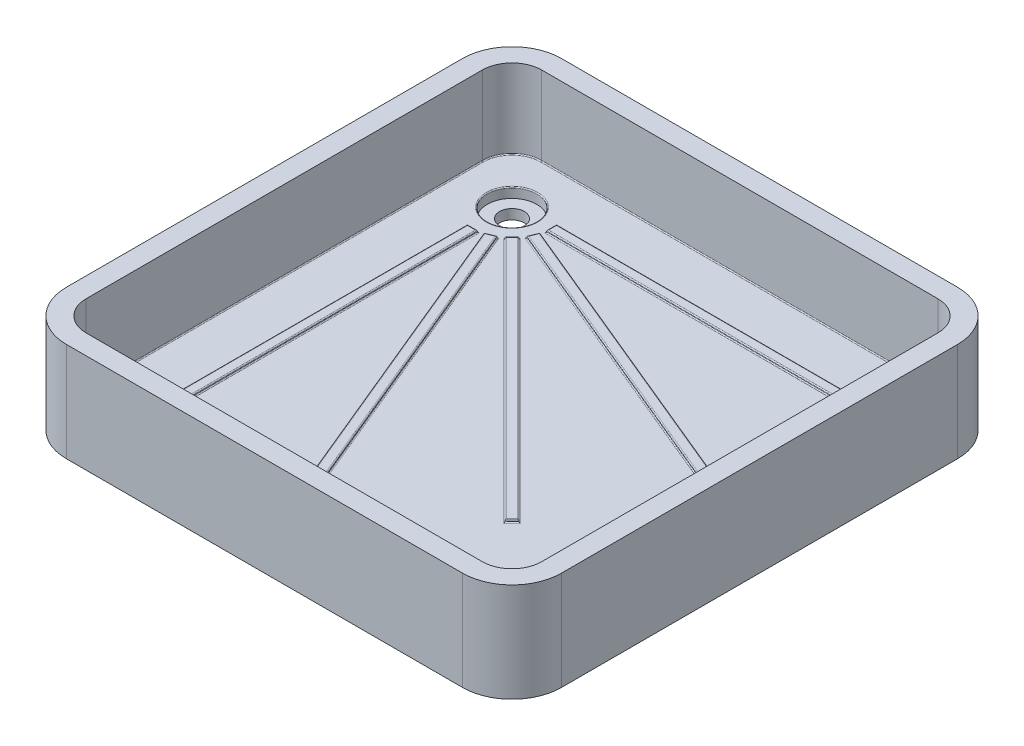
from build123d import *

# Parameters (mm, degrees)
ESQUISSE1_W                  = 1000
ESQUISSE1_H                  = 1000
BOSS_EXTRU_1_DEPTH           = 200
CONG_1_R                     = 100
COQUE1_T                     = -40
ESQUISSE2_R                  = 50
ENL_V_MAT_EXTRU_1_DEPTH      = 20
ESQUISSE3_R                  = 25
ENL_V_MAT_EXTRU_2_DEPTH      = 20
ESQUISSE4_W                  = 700
ESQUISSE4_H                  = 20
BOSS_EXTRU_2_DEPTH           = 5
R_P_TITION_CIRCULAIRE1_COUNT = 5
R_P_TITION_CIRCULAIRE1_ANGLE = 90
CONG_2_R                     = 2


with BuildPart() as part:
    # Esquisse1 → Boss.-Extru.1 (new body)
    with BuildSketch(Plane(origin=(0, 0, 0), x_dir=(1, 0, 0), z_dir=(0, 1, 0))):
        Rectangle(ESQUISSE1_W, ESQUISSE1_H)
    extrude(amount=BOSS_EXTRU_1_DEPTH)

    # Cong_1
    cong_1_edges = [part.edges().sort_by_distance(p)[0] for p in [
        (-500, 100, -500),
        (500, 100, -500),
        (500, 100, 500),
        (-500, 100, 500),
    ]]
    fillet(cong_1_edges, radius=CONG_1_R)

    # Coque1
    coque1_openings = [part.faces().sort_by_distance(p)[0] for p in [
        (0, 200, 0),
    ]]
    offset(amount=COQUE1_T, openings=coque1_openings, kind=Kind.INTERSECTION)

    # Esquisse2 → Enl_v. mat.-Extru.1 (cut)
    with BuildSketch(Plane(origin=(0, 40, 0), x_dir=(1, 0, 0), z_dir=(0, 1, 0))):
        with Locations(Location((-350, 350, 0), (0, 0, 270))):
            Circle(ESQUISSE2_R)
    extrude(amount=-ENL_V_MAT_EXTRU_1_DEPTH, mode=Mode.SUBTRACT)

    # Esquisse3 → Enl_v. mat.-Extru.2 (cut)
    with BuildSketch(Plane(origin=(0, 20, 0), x_dir=(1, 0, 0), z_dir=(0, 1, 0))):
        with Locations(Location((-350, 350, 0), (0, 0, 270))):
            Circle(ESQUISSE3_R)
    extrude(amount=-ENL_V_MAT_EXTRU_2_DEPTH, mode=Mode.SUBTRACT)

    # Esquisse4 → Boss.-Extru.2 (add)
    with BuildSketch(Plane(origin=(0, 40, 0), x_dir=(1, 0, 0), z_dir=(0, 1, 0))):
        with Locations((80, 350)):
            Rectangle(ESQUISSE4_W, ESQUISSE4_H)
    boss_extru_2 = extrude(amount=BOSS_EXTRU_2_DEPTH)

    # R_p_tition circulaire1: Boss.-Extru.2 ×5 about axis
    r_p_tition_circulaire1_axis = Axis((-350, 0, -350), (0, -1, 0))
    for i in range(1, R_P_TITION_CIRCULAIRE1_COUNT):
        add(boss_extru_2.rotate(r_p_tition_circulaire1_axis, i * R_P_TITION_CIRCULAIRE1_ANGLE / (R_P_TITION_CIRCULAIRE1_COUNT - 1)))

    # Cong_2
    cong_2_edges = [part.edges().sort_by_distance(p)[0] for p in [
        (-319.385325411, 40, -276.089637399),
        (-194.684919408, 40, 51.095033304),
        (-51.506922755, 40, 370.626035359),
        (-176.207328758, 40, 43.441364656),
        (-319.385325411, 45, -276.089637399),
        (-194.684919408, 45, 51.095033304),
        (-51.506922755, 45, 370.626035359),
        (-176.207328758, 45, 43.441364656),
        (-350, 40, -270),
        (-360, 40, 80),
        (-350, 40, 430),
        (-340, 40, 80),
        (-350, 45, -270),
        (-360, 45, 80),
        (-350, 45, 430),
        (-340, 45, 80),
        (-460, 40, 0),
        (0, 40, 460),
        (460, 40, 0),
        (0, 40, -460),
        (-442.426406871, 40, -442.426406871),
        (442.426406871, 40, -442.426406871),
        (442.426406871, 40, 442.426406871),
        (-442.426406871, 40, 442.426406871),
        (-350, 40, -400),
        (-270, 40, -350),
        (80, 40, -340),
        (430, 40, -350),
        (80, 40, -360),
        (-270, 45, -350),
        (80, 45, -340),
        (430, 45, -350),
        (80, 45, -360),
        (-276.089637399, 40, -319.385325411),
        (43.441364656, 40, -176.207328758),
        (370.626035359, 40, -51.506922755),
        (51.095033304, 40, -194.684919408),
        (-276.089637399, 45, -319.385325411),
        (43.441364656, 45, -176.207328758),
        (370.626035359, 45, -51.506922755),
        (51.095033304, 45, -194.684919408),
        (-293.431457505, 40, -293.431457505),
        (-53.015151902, 40, -38.873016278),
        (201.543289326, 40, 201.543289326),
        (-38.873016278, 40, -53.015151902),
        (-293.431457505, 45, -293.431457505),
        (-53.015151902, 45, -38.873016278),
        (201.543289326, 45, 201.543289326),
        (-38.873016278, 45, -53.015151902),
    ]]
    fillet(cong_2_edges, radius=CONG_2_R)


solid = part.part
